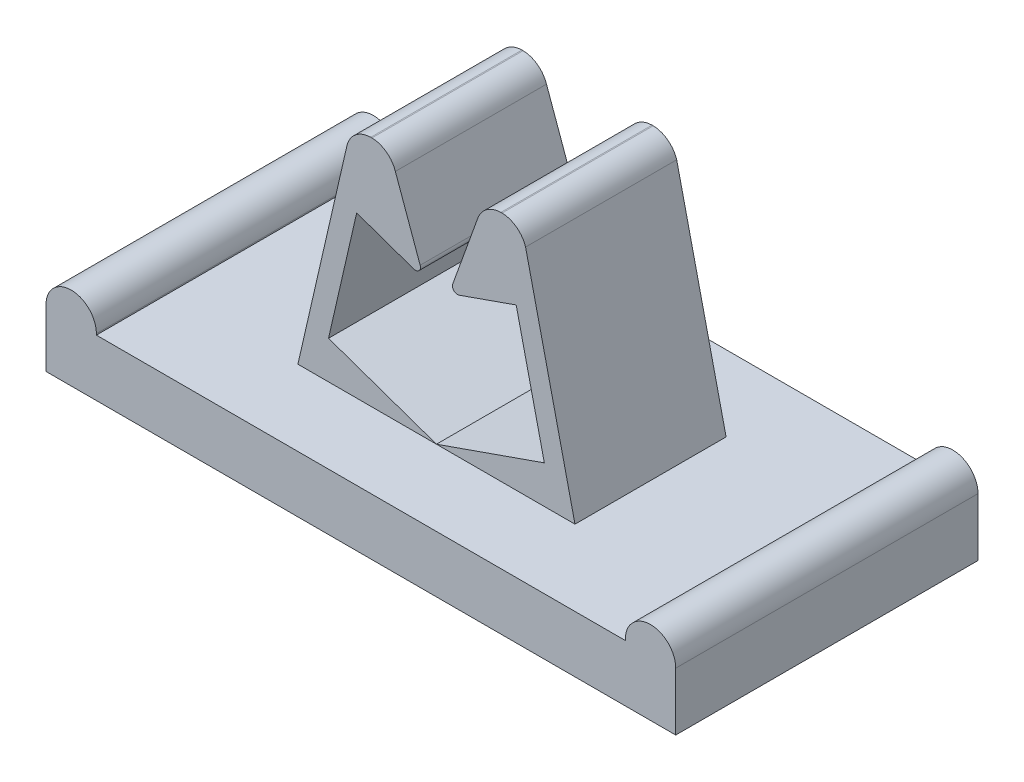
ISO-10303-21;
HEADER;
FILE_DESCRIPTION(('STEP AP214'),'2;1');
FILE_NAME('part.step','',(''),(''),'','','');
FILE_SCHEMA(('AUTOMOTIVE_DESIGN { 1 0 10303 214 1 1 1 1 }'));
ENDSEC;
DATA;
#1=APPLICATION_CONTEXT('core data for automotive mechanical design processes');
#2=APPLICATION_PROTOCOL_DEFINITION('international standard','automotive_design',2000,#1);
#3=PRODUCT_CONTEXT('',#1,'mechanical');
#4=PRODUCT('Part','Part','',(#3));
#5=PRODUCT_RELATED_PRODUCT_CATEGORY('part','',(#4));
#6=PRODUCT_DEFINITION_FORMATION('','',#4);
#7=PRODUCT_DEFINITION_CONTEXT('part definition',#1,'design');
#8=PRODUCT_DEFINITION('design','',#6,#7);
#9=PRODUCT_DEFINITION_SHAPE('','',#8);
#10=(LENGTH_UNIT() NAMED_UNIT(*) SI_UNIT(.MILLI.,.METRE.));
#11=(NAMED_UNIT(*) PLANE_ANGLE_UNIT() SI_UNIT($,.RADIAN.));
#12=(NAMED_UNIT(*) SI_UNIT($,.STERADIAN.) SOLID_ANGLE_UNIT());
#13=UNCERTAINTY_MEASURE_WITH_UNIT(LENGTH_MEASURE(1.E-05),#10,'distance_accuracy_value','');
#14=(GEOMETRIC_REPRESENTATION_CONTEXT(3) GLOBAL_UNCERTAINTY_ASSIGNED_CONTEXT((#13)) GLOBAL_UNIT_ASSIGNED_CONTEXT((#10,
#11,#12)) REPRESENTATION_CONTEXT('',''));
#15=CARTESIAN_POINT('',(0.,0.,0.));
#16=DIRECTION('',(0.,0.,1.));
#17=DIRECTION('',(1.,0.,0.));
#18=AXIS2_PLACEMENT_3D('',#15,#16,#17);
#19=CARTESIAN_POINT('',(0.,11.5,-12.));
#20=DIRECTION('',(0.,-1.,0.));
#21=DIRECTION('',(0.,0.,-1.));
#22=AXIS2_PLACEMENT_3D('',#19,#20,#21);
#23=PLANE('',#22);
#24=DIRECTION('',(0.,0.,1.));
#25=VECTOR('',#24,1.);
#26=CARTESIAN_POINT('',(9.94065149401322,11.5,-12.));
#27=LINE('',#26,#25);
#28=CARTESIAN_POINT('',(9.94065149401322,11.5,-9.));
#29=VERTEX_POINT('',#28);
#30=CARTESIAN_POINT('',(9.94065149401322,11.5,-3.));
#31=VERTEX_POINT('',#30);
#32=EDGE_CURVE('E396',#29,#31,#27,.T.);
#33=ORIENTED_EDGE('',*,*,#32,.F.);
#34=DIRECTION('',(-1.,0.,0.));
#35=VECTOR('',#34,1.);
#36=CARTESIAN_POINT('',(0.,11.5,-9.));
#37=LINE('',#36,#35);
#38=CARTESIAN_POINT('',(9.89434520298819,11.5,-9.));
#39=VERTEX_POINT('',#38);
#40=EDGE_CURVE('E774',#29,#39,#37,.T.);
#41=ORIENTED_EDGE('',*,*,#40,.T.);
#42=DIRECTION('',(0.,0.,1.));
#43=VECTOR('',#42,1.);
#44=CARTESIAN_POINT('',(9.89434520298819,11.5,-12.));
#45=LINE('',#44,#43);
#46=CARTESIAN_POINT('',(9.89434520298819,11.5,-3.));
#47=VERTEX_POINT('',#46);
#48=EDGE_CURVE('E376',#39,#47,#45,.T.);
#49=ORIENTED_EDGE('',*,*,#48,.T.);
#50=DIRECTION('',(1.,0.,0.));
#51=VECTOR('',#50,1.);
#52=CARTESIAN_POINT('',(0.,11.5,-3.));
#53=LINE('',#52,#51);
#54=EDGE_CURVE('E697',#47,#31,#53,.T.);
#55=ORIENTED_EDGE('',*,*,#54,.T.);
#56=EDGE_LOOP('',(#33,#41,#49,#55));
#57=FACE_BOUND('',#56,.T.);
#58=ADVANCED_FACE('F35',(#57),#23,.F.);
#59=CARTESIAN_POINT('',(25.,11.5,0.));
#60=DIRECTION('',(-1.,0.,0.));
#61=DIRECTION('',(0.,0.,1.));
#62=AXIS2_PLACEMENT_3D('',#59,#60,#61);
#63=PLANE('',#62);
#64=DIRECTION('',(0.,0.,1.));
#65=VECTOR('',#64,1.);
#66=CARTESIAN_POINT('',(25.,2.3,-12.));
#67=LINE('',#66,#65);
#68=CARTESIAN_POINT('',(25.,2.3,-12.));
#69=VERTEX_POINT('',#68);
#70=CARTESIAN_POINT('',(25.,2.3,0.));
#71=VERTEX_POINT('',#70);
#72=EDGE_CURVE('E255',#69,#71,#67,.T.);
#73=ORIENTED_EDGE('',*,*,#72,.T.);
#74=DIRECTION('',(0.,-1.,0.));
#75=VECTOR('',#74,1.);
#76=CARTESIAN_POINT('',(25.,11.5,0.));
#77=LINE('',#76,#75);
#78=CARTESIAN_POINT('',(25.,0.,0.));
#79=VERTEX_POINT('',#78);
#80=EDGE_CURVE('E275',#71,#79,#77,.T.);
#81=ORIENTED_EDGE('',*,*,#80,.T.);
#82=DIRECTION('',(0.,0.,-1.));
#83=VECTOR('',#82,1.);
#84=CARTESIAN_POINT('',(25.,0.,0.));
#85=LINE('',#84,#83);
#86=CARTESIAN_POINT('',(25.,0.,-12.));
#87=VERTEX_POINT('',#86);
#88=EDGE_CURVE('E265',#79,#87,#85,.T.);
#89=ORIENTED_EDGE('',*,*,#88,.T.);
#90=DIRECTION('',(0.,-1.,0.));
#91=VECTOR('',#90,1.);
#92=CARTESIAN_POINT('',(25.,11.5,-12.));
#93=LINE('',#92,#91);
#94=EDGE_CURVE('E273',#69,#87,#93,.T.);
#95=ORIENTED_EDGE('',*,*,#94,.F.);
#96=EDGE_LOOP('',(#73,#81,#89,#95));
#97=FACE_BOUND('',#96,.T.);
#98=ADVANCED_FACE('F302',(#97),#63,.F.);
#99=CARTESIAN_POINT('',(0.,11.5,0.));
#100=DIRECTION('',(1.,0.,0.));
#101=DIRECTION('',(0.,0.,-1.));
#102=AXIS2_PLACEMENT_3D('',#99,#100,#101);
#103=PLANE('',#102);
#104=DIRECTION('',(0.,-1.,0.));
#105=VECTOR('',#104,1.);
#106=CARTESIAN_POINT('',(0.,11.5,0.));
#107=LINE('',#106,#105);
#108=CARTESIAN_POINT('',(1.3392065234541E-12,2.3,0.));
#109=VERTEX_POINT('',#108);
#110=CARTESIAN_POINT('',(0.,0.,0.));
#111=VERTEX_POINT('',#110);
#112=EDGE_CURVE('E43',#109,#111,#107,.T.);
#113=ORIENTED_EDGE('',*,*,#112,.F.);
#114=DIRECTION('',(0.,0.,1.));
#115=VECTOR('',#114,1.);
#116=CARTESIAN_POINT('',(1.3392065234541E-12,2.3,-12.));
#117=LINE('',#116,#115);
#118=CARTESIAN_POINT('',(1.3392065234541E-12,2.3,-12.));
#119=VERTEX_POINT('',#118);
#120=EDGE_CURVE('E293',#119,#109,#117,.T.);
#121=ORIENTED_EDGE('',*,*,#120,.F.);
#122=DIRECTION('',(0.,-1.,0.));
#123=VECTOR('',#122,1.);
#124=CARTESIAN_POINT('',(0.,11.5,-12.));
#125=LINE('',#124,#123);
#126=CARTESIAN_POINT('',(0.,0.,-12.));
#127=VERTEX_POINT('',#126);
#128=EDGE_CURVE('E271',#119,#127,#125,.T.);
#129=ORIENTED_EDGE('',*,*,#128,.T.);
#130=DIRECTION('',(0.,0.,1.));
#131=VECTOR('',#130,1.);
#132=CARTESIAN_POINT('',(0.,0.,0.));
#133=LINE('',#132,#131);
#134=EDGE_CURVE('E242',#127,#111,#133,.T.);
#135=ORIENTED_EDGE('',*,*,#134,.T.);
#136=EDGE_LOOP('',(#113,#121,#129,#135));
#137=FACE_BOUND('',#136,.T.);
#138=ADVANCED_FACE('F37',(#137),#103,.F.);
#139=CARTESIAN_POINT('',(0.,11.5,0.));
#140=DIRECTION('',(0.,0.,-1.));
#141=DIRECTION('',(-1.,0.,0.));
#142=AXIS2_PLACEMENT_3D('',#139,#140,#141);
#143=PLANE('',#142);
#144=DIRECTION('',(1.,0.,0.));
#145=VECTOR('',#144,1.);
#146=CARTESIAN_POINT('',(18.0000000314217,2.24999995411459,0.));
#147=LINE('',#146,#145);
#148=CARTESIAN_POINT('',(2.00000000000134,2.24999995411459,0.));
#149=VERTEX_POINT('',#148);
#150=CARTESIAN_POINT('',(23.,2.24999995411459,0.));
#151=VERTEX_POINT('',#150);
#152=EDGE_CURVE('E313',#149,#151,#147,.T.);
#153=ORIENTED_EDGE('',*,*,#152,.F.);
#154=DIRECTION('',(0.,-1.,0.));
#155=VECTOR('',#154,1.);
#156=CARTESIAN_POINT('',(2.00000000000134,2.24999995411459,0.));
#157=LINE('',#156,#155);
#158=CARTESIAN_POINT('',(2.00000000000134,2.3,0.));
#159=VERTEX_POINT('',#158);
#160=EDGE_CURVE('E370',#159,#149,#157,.T.);
#161=ORIENTED_EDGE('',*,*,#160,.F.);
#162=CARTESIAN_POINT('',(1.00000000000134,2.3,0.));
#163=DIRECTION('',(0.,0.,-1.));
#164=DIRECTION('',(-1.,0.,0.));
#165=AXIS2_PLACEMENT_3D('',#162,#163,#164);
#166=CIRCLE('',#165,1.);
#167=EDGE_CURVE('E285',#109,#159,#166,.T.);
#168=ORIENTED_EDGE('',*,*,#167,.F.);
#169=ORIENTED_EDGE('',*,*,#112,.T.);
#170=DIRECTION('',(1.,0.,0.));
#171=VECTOR('',#170,1.);
#172=CARTESIAN_POINT('',(0.,0.,0.));
#173=LINE('',#172,#171);
#174=EDGE_CURVE('E246',#111,#79,#173,.T.);
#175=ORIENTED_EDGE('',*,*,#174,.T.);
#176=ORIENTED_EDGE('',*,*,#80,.F.);
#177=CARTESIAN_POINT('',(24.,2.3,0.));
#178=DIRECTION('',(0.,0.,-1.));
#179=DIRECTION('',(1.,0.,0.));
#180=AXIS2_PLACEMENT_3D('',#177,#178,#179);
#181=CIRCLE('',#180,1.);
#182=CARTESIAN_POINT('',(23.,2.3,0.));
#183=VERTEX_POINT('',#182);
#184=EDGE_CURVE('E305',#183,#71,#181,.T.);
#185=ORIENTED_EDGE('',*,*,#184,.F.);
#186=DIRECTION('',(0.,1.,0.));
#187=VECTOR('',#186,1.);
#188=CARTESIAN_POINT('',(23.,2.24999995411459,0.));
#189=LINE('',#188,#187);
#190=EDGE_CURVE('E307',#151,#183,#189,.T.);
#191=ORIENTED_EDGE('',*,*,#190,.F.);
#192=EDGE_LOOP('',(#153,#161,#168,#169,#175,#176,#185,#191));
#193=FACE_BOUND('',#192,.T.);
#194=ADVANCED_FACE('F280',(#193),#143,.F.);
#195=CARTESIAN_POINT('',(0.,11.5,-12.));
#196=DIRECTION('',(0.,0.,1.));
#197=DIRECTION('',(1.,0.,0.));
#198=AXIS2_PLACEMENT_3D('',#195,#196,#197);
#199=PLANE('',#198);
#200=DIRECTION('',(0.,-1.,0.));
#201=VECTOR('',#200,1.);
#202=CARTESIAN_POINT('',(2.00000000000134,2.24999995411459,-12.));
#203=LINE('',#202,#201);
#204=CARTESIAN_POINT('',(2.00000000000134,2.3,-12.));
#205=VERTEX_POINT('',#204);
#206=CARTESIAN_POINT('',(2.00000000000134,2.24999995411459,-12.));
#207=VERTEX_POINT('',#206);
#208=EDGE_CURVE('E57',#205,#207,#203,.T.);
#209=ORIENTED_EDGE('',*,*,#208,.T.);
#210=DIRECTION('',(1.,0.,0.));
#211=VECTOR('',#210,1.);
#212=CARTESIAN_POINT('',(18.0000000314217,2.24999995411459,-12.));
#213=LINE('',#212,#211);
#214=CARTESIAN_POINT('',(23.,2.24999995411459,-12.));
#215=VERTEX_POINT('',#214);
#216=EDGE_CURVE('E309',#207,#215,#213,.T.);
#217=ORIENTED_EDGE('',*,*,#216,.T.);
#218=DIRECTION('',(0.,1.,0.));
#219=VECTOR('',#218,1.);
#220=CARTESIAN_POINT('',(23.,2.24999995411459,-12.));
#221=LINE('',#220,#219);
#222=CARTESIAN_POINT('',(23.,2.3,-12.));
#223=VERTEX_POINT('',#222);
#224=EDGE_CURVE('E311',#215,#223,#221,.T.);
#225=ORIENTED_EDGE('',*,*,#224,.T.);
#226=CARTESIAN_POINT('',(24.,2.3,-12.));
#227=DIRECTION('',(0.,0.,-1.));
#228=DIRECTION('',(1.,0.,0.));
#229=AXIS2_PLACEMENT_3D('',#226,#227,#228);
#230=CIRCLE('',#229,1.);
#231=EDGE_CURVE('E251',#223,#69,#230,.T.);
#232=ORIENTED_EDGE('',*,*,#231,.T.);
#233=ORIENTED_EDGE('',*,*,#94,.T.);
#234=DIRECTION('',(-1.,0.,0.));
#235=VECTOR('',#234,1.);
#236=CARTESIAN_POINT('',(0.,0.,-12.));
#237=LINE('',#236,#235);
#238=EDGE_CURVE('E268',#87,#127,#237,.T.);
#239=ORIENTED_EDGE('',*,*,#238,.T.);
#240=ORIENTED_EDGE('',*,*,#128,.F.);
#241=CARTESIAN_POINT('',(1.00000000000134,2.3,-12.));
#242=DIRECTION('',(0.,0.,-1.));
#243=DIRECTION('',(-1.,0.,0.));
#244=AXIS2_PLACEMENT_3D('',#241,#242,#243);
#245=CIRCLE('',#244,1.);
#246=EDGE_CURVE('E373',#119,#205,#245,.T.);
#247=ORIENTED_EDGE('',*,*,#246,.T.);
#248=EDGE_LOOP('',(#209,#217,#225,#232,#233,#239,#240,#247));
#249=FACE_BOUND('',#248,.T.);
#250=ADVANCED_FACE('F296',(#249),#199,.F.);
#251=DIRECTION('',(0.,0.,1.));
#252=VECTOR('',#251,1.);
#253=CARTESIAN_POINT('',(15.1056547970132,11.5,-12.));
#254=LINE('',#253,#252);
#255=CARTESIAN_POINT('',(15.1056547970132,11.5,-9.));
#256=VERTEX_POINT('',#255);
#257=CARTESIAN_POINT('',(15.1056547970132,11.5,-3.));
#258=VERTEX_POINT('',#257);
#259=EDGE_CURVE('E248',#256,#258,#254,.T.);
#260=ORIENTED_EDGE('',*,*,#259,.F.);
#261=DIRECTION('',(-1.,0.,0.));
#262=VECTOR('',#261,1.);
#263=CARTESIAN_POINT('',(0.,11.5,-9.));
#264=LINE('',#263,#262);
#265=CARTESIAN_POINT('',(15.0593485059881,11.5,-9.));
#266=VERTEX_POINT('',#265);
#267=EDGE_CURVE('E352',#256,#266,#264,.T.);
#268=ORIENTED_EDGE('',*,*,#267,.T.);
#269=DIRECTION('',(0.,0.,1.));
#270=VECTOR('',#269,1.);
#271=CARTESIAN_POINT('',(15.0593485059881,11.5,-12.));
#272=LINE('',#271,#270);
#273=CARTESIAN_POINT('',(15.0593485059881,11.5,-3.));
#274=VERTEX_POINT('',#273);
#275=EDGE_CURVE('E398',#266,#274,#272,.T.);
#276=ORIENTED_EDGE('',*,*,#275,.T.);
#277=DIRECTION('',(1.,0.,0.));
#278=VECTOR('',#277,1.);
#279=CARTESIAN_POINT('',(0.,11.5,-3.));
#280=LINE('',#279,#278);
#281=EDGE_CURVE('E355',#274,#258,#280,.T.);
#282=ORIENTED_EDGE('',*,*,#281,.T.);
#283=EDGE_LOOP('',(#260,#268,#276,#282));
#284=FACE_BOUND('',#283,.T.);
#285=ADVANCED_FACE('F335',(#284),#23,.F.);
#286=CARTESIAN_POINT('',(0.,0.,-12.));
#287=DIRECTION('',(0.,-1.,0.));
#288=DIRECTION('',(0.,0.,-1.));
#289=AXIS2_PLACEMENT_3D('',#286,#287,#288);
#290=PLANE('',#289);
#291=ORIENTED_EDGE('',*,*,#134,.F.);
#292=ORIENTED_EDGE('',*,*,#238,.F.);
#293=ORIENTED_EDGE('',*,*,#88,.F.);
#294=ORIENTED_EDGE('',*,*,#174,.F.);
#295=EDGE_LOOP('',(#291,#292,#293,#294));
#296=FACE_BOUND('',#295,.T.);
#297=ADVANCED_FACE('F290',(#296),#290,.T.);
#298=CARTESIAN_POINT('',(18.0000000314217,2.24999995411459,-12.));
#299=DIRECTION('',(0.,-1.,0.));
#300=DIRECTION('',(0.,0.,-1.));
#301=AXIS2_PLACEMENT_3D('',#298,#299,#300);
#302=PLANE('',#301);
#303=DIRECTION('',(-1.,0.,0.));
#304=VECTOR('',#303,1.);
#305=CARTESIAN_POINT('',(20.,2.25,-9.));
#306=LINE('',#305,#304);
#307=CARTESIAN_POINT('',(18.0000000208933,2.25,-9.));
#308=VERTEX_POINT('',#307);
#309=CARTESIAN_POINT('',(12.5000000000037,2.25,-9.));
#310=VERTEX_POINT('',#309);
#311=EDGE_CURVE('E219',#308,#310,#306,.T.);
#312=ORIENTED_EDGE('',*,*,#311,.F.);
#313=DIRECTION('',(0.,0.,1.));
#314=VECTOR('',#313,1.);
#315=CARTESIAN_POINT('',(18.0000000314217,2.24999995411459,-12.));
#316=LINE('',#315,#314);
#317=CARTESIAN_POINT('',(18.0000000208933,2.25,-3.));
#318=VERTEX_POINT('',#317);
#319=EDGE_CURVE('E233',#308,#318,#316,.T.);
#320=ORIENTED_EDGE('',*,*,#319,.T.);
#321=DIRECTION('',(-1.,0.,0.));
#322=VECTOR('',#321,1.);
#323=CARTESIAN_POINT('',(20.,2.25,-3.));
#324=LINE('',#323,#322);
#325=CARTESIAN_POINT('',(12.5000000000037,2.25,-3.));
#326=VERTEX_POINT('',#325);
#327=EDGE_CURVE('E686',#318,#326,#324,.T.);
#328=ORIENTED_EDGE('',*,*,#327,.T.);
#329=CARTESIAN_POINT('',(6.9999999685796,2.24999995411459,-3.));
#330=VERTEX_POINT('',#329);
#331=EDGE_CURVE('E226',#326,#330,#324,.T.);
#332=ORIENTED_EDGE('',*,*,#331,.T.);
#333=DIRECTION('',(0.,0.,1.));
#334=VECTOR('',#333,1.);
#335=CARTESIAN_POINT('',(6.9999999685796,2.24999995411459,-12.));
#336=LINE('',#335,#334);
#337=CARTESIAN_POINT('',(6.99999997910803,2.25,-9.));
#338=VERTEX_POINT('',#337);
#339=EDGE_CURVE('E49',#338,#330,#336,.T.);
#340=ORIENTED_EDGE('',*,*,#339,.F.);
#341=EDGE_CURVE('E235',#310,#338,#306,.T.);
#342=ORIENTED_EDGE('',*,*,#341,.F.);
#343=EDGE_LOOP('',(#312,#320,#328,#332,#340,#342));
#344=FACE_BOUND('',#343,.T.);
#345=DIRECTION('',(0.,0.,1.));
#346=VECTOR('',#345,1.);
#347=CARTESIAN_POINT('',(23.,2.24999995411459,-12.));
#348=LINE('',#347,#346);
#349=EDGE_CURVE('E260',#215,#151,#348,.T.);
#350=ORIENTED_EDGE('',*,*,#349,.F.);
#351=ORIENTED_EDGE('',*,*,#216,.F.);
#352=DIRECTION('',(0.,0.,1.));
#353=VECTOR('',#352,1.);
#354=CARTESIAN_POINT('',(2.00000000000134,2.24999995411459,-12.));
#355=LINE('',#354,#353);
#356=EDGE_CURVE('E381',#207,#149,#355,.T.);
#357=ORIENTED_EDGE('',*,*,#356,.T.);
#358=ORIENTED_EDGE('',*,*,#152,.T.);
#359=EDGE_LOOP('',(#350,#351,#357,#358));
#360=FACE_BOUND('',#359,.T.);
#361=ADVANCED_FACE('F230',(#344,#360),#302,.F.);
#362=CARTESIAN_POINT('',(16.038627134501,10.7981391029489,-12.));
#363=DIRECTION('',(-0.97467209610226,-0.223638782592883,0.));
#364=DIRECTION('',(0.223638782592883,-0.97467209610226,0.));
#365=AXIS2_PLACEMENT_3D('',#362,#363,#364);
#366=PLANE('',#365);
#367=ORIENTED_EDGE('',*,*,#319,.F.);
#368=DIRECTION('',(-0.223638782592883,0.97467209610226,0.));
#369=VECTOR('',#368,1.);
#370=CARTESIAN_POINT('',(16.038627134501,10.7981391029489,-9.));
#371=LINE('',#370,#369);
#372=CARTESIAN_POINT('',(16.038627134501,10.7981391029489,-9.));
#373=VERTEX_POINT('',#372);
#374=EDGE_CURVE('E216',#308,#373,#371,.T.);
#375=ORIENTED_EDGE('',*,*,#374,.T.);
#376=DIRECTION('',(0.,0.,1.));
#377=VECTOR('',#376,1.);
#378=CARTESIAN_POINT('',(16.038627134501,10.7981391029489,-12.));
#379=LINE('',#378,#377);
#380=CARTESIAN_POINT('',(16.038627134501,10.7981391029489,-3.));
#381=VERTEX_POINT('',#380);
#382=EDGE_CURVE('E243',#373,#381,#379,.T.);
#383=ORIENTED_EDGE('',*,*,#382,.T.);
#384=DIRECTION('',(0.223638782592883,-0.97467209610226,0.));
#385=VECTOR('',#384,1.);
#386=CARTESIAN_POINT('',(16.038627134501,10.7981391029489,-3.));
#387=LINE('',#386,#385);
#388=EDGE_CURVE('E241',#381,#318,#387,.T.);
#389=ORIENTED_EDGE('',*,*,#388,.T.);
#390=EDGE_LOOP('',(#367,#375,#383,#389));
#391=FACE_BOUND('',#390,.T.);
#392=ADVANCED_FACE('F239',(#391),#366,.F.);
#393=CARTESIAN_POINT('',(15.0825016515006,10.4981999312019,-12.));
#394=DIRECTION('',(0.,0.,1.));
#395=DIRECTION('',(1.,0.,0.));
#396=AXIS2_PLACEMENT_3D('',#393,#394,#395);
#397=CYLINDRICAL_SURFACE('',#396,1.00206758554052);
#398=ORIENTED_EDGE('',*,*,#382,.F.);
#399=CARTESIAN_POINT('',(15.0825016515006,10.4981999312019,-9.));
#400=DIRECTION('',(0.,0.,1.));
#401=DIRECTION('',(1.,0.,0.));
#402=AXIS2_PLACEMENT_3D('',#399,#400,#401);
#403=CIRCLE('',#402,1.00206758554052);
#404=EDGE_CURVE('E222',#373,#256,#403,.T.);
#405=ORIENTED_EDGE('',*,*,#404,.T.);
#406=ORIENTED_EDGE('',*,*,#259,.T.);
#407=CARTESIAN_POINT('',(15.0825016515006,10.4981999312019,-3.));
#408=DIRECTION('',(0.,0.,-1.));
#409=DIRECTION('',(-1.,0.,0.));
#410=AXIS2_PLACEMENT_3D('',#407,#408,#409);
#411=CIRCLE('',#410,1.00206758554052);
#412=EDGE_CURVE('E358',#258,#381,#411,.T.);
#413=ORIENTED_EDGE('',*,*,#412,.T.);
#414=EDGE_LOOP('',(#398,#405,#406,#413));
#415=FACE_BOUND('',#414,.T.);
#416=ADVANCED_FACE('F322',(#415),#397,.T.);
#417=CARTESIAN_POINT('',(24.,2.3,-12.));
#418=DIRECTION('',(0.,0.,1.));
#419=DIRECTION('',(1.,0.,0.));
#420=AXIS2_PLACEMENT_3D('',#417,#418,#419);
#421=CYLINDRICAL_SURFACE('',#420,1.);
#422=ORIENTED_EDGE('',*,*,#184,.T.);
#423=ORIENTED_EDGE('',*,*,#72,.F.);
#424=ORIENTED_EDGE('',*,*,#231,.F.);
#425=DIRECTION('',(0.,0.,1.));
#426=VECTOR('',#425,1.);
#427=CARTESIAN_POINT('',(23.,2.3,-12.));
#428=LINE('',#427,#426);
#429=EDGE_CURVE('E258',#223,#183,#428,.T.);
#430=ORIENTED_EDGE('',*,*,#429,.T.);
#431=EDGE_LOOP('',(#422,#423,#424,#430));
#432=FACE_BOUND('',#431,.T.);
#433=ADVANCED_FACE('F320',(#432),#421,.T.);
#434=CARTESIAN_POINT('',(23.,2.24999995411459,-12.));
#435=DIRECTION('',(1.,0.,0.));
#436=DIRECTION('',(0.,0.,-1.));
#437=AXIS2_PLACEMENT_3D('',#434,#435,#436);
#438=PLANE('',#437);
#439=ORIENTED_EDGE('',*,*,#190,.T.);
#440=ORIENTED_EDGE('',*,*,#429,.F.);
#441=ORIENTED_EDGE('',*,*,#224,.F.);
#442=ORIENTED_EDGE('',*,*,#349,.T.);
#443=EDGE_LOOP('',(#439,#440,#441,#442));
#444=FACE_BOUND('',#443,.T.);
#445=ADVANCED_FACE('F319',(#444),#438,.F.);
#446=CARTESIAN_POINT('',(9.3335647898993,8.61946996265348,-12.));
#447=DIRECTION('',(-0.974672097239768,0.223638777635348,0.));
#448=DIRECTION('',(-0.223638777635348,-0.974672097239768,0.));
#449=AXIS2_PLACEMENT_3D('',#446,#447,#448);
#450=PLANE('',#449);
#451=DIRECTION('',(0.,0.,1.));
#452=VECTOR('',#451,1.);
#453=CARTESIAN_POINT('',(8.21626358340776,3.75000000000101,-12.));
#454=LINE('',#453,#452);
#455=CARTESIAN_POINT('',(8.21626358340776,3.75000000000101,-9.));
#456=VERTEX_POINT('',#455);
#457=CARTESIAN_POINT('',(8.21626358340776,3.75000000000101,-3.));
#458=VERTEX_POINT('',#457);
#459=EDGE_CURVE('E379',#456,#458,#454,.T.);
#460=ORIENTED_EDGE('',*,*,#459,.F.);
#461=DIRECTION('',(0.223638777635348,0.974672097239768,0.));
#462=VECTOR('',#461,1.);
#463=CARTESIAN_POINT('',(9.3335647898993,8.61946996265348,-9.));
#464=LINE('',#463,#462);
#465=CARTESIAN_POINT('',(9.3335647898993,8.61946996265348,-9.));
#466=VERTEX_POINT('',#465);
#467=EDGE_CURVE('E758',#456,#466,#464,.T.);
#468=ORIENTED_EDGE('',*,*,#467,.T.);
#469=DIRECTION('',(0.,0.,1.));
#470=VECTOR('',#469,1.);
#471=CARTESIAN_POINT('',(9.3335647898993,8.61946996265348,-12.));
#472=LINE('',#471,#470);
#473=CARTESIAN_POINT('',(9.3335647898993,8.61946996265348,-3.));
#474=VERTEX_POINT('',#473);
#475=EDGE_CURVE('E388',#466,#474,#472,.T.);
#476=ORIENTED_EDGE('',*,*,#475,.T.);
#477=DIRECTION('',(-0.223638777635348,-0.974672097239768,0.));
#478=VECTOR('',#477,1.);
#479=CARTESIAN_POINT('',(9.3335647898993,8.61946996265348,-3.));
#480=LINE('',#479,#478);
#481=EDGE_CURVE('E714',#474,#458,#480,.T.);
#482=ORIENTED_EDGE('',*,*,#481,.T.);
#483=EDGE_LOOP('',(#460,#468,#476,#482));
#484=FACE_BOUND('',#483,.T.);
#485=ADVANCED_FACE('F328',(#484),#450,.F.);
#486=CARTESIAN_POINT('',(9.3335647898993,8.61946996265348,-12.));
#487=DIRECTION('',(0.331571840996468,0.943429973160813,0.));
#488=DIRECTION('',(-0.943429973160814,0.331571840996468,0.));
#489=AXIS2_PLACEMENT_3D('',#486,#487,#488);
#490=PLANE('',#489);
#491=ORIENTED_EDGE('',*,*,#475,.F.);
#492=DIRECTION('',(0.943429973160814,-0.331571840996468,0.));
#493=VECTOR('',#492,1.);
#494=CARTESIAN_POINT('',(9.3335647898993,8.61946996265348,-9.));
#495=LINE('',#494,#493);
#496=CARTESIAN_POINT('',(11.5990840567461,7.82324510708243,-9.));
#497=VERTEX_POINT('',#496);
#498=EDGE_CURVE('E760',#466,#497,#495,.T.);
#499=ORIENTED_EDGE('',*,*,#498,.T.);
#500=DIRECTION('',(0.,0.,1.));
#501=VECTOR('',#500,1.);
#502=CARTESIAN_POINT('',(11.5990840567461,7.82324510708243,-12.));
#503=LINE('',#502,#501);
#504=CARTESIAN_POINT('',(11.5990840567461,7.82324510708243,-3.));
#505=VERTEX_POINT('',#504);
#506=EDGE_CURVE('E390',#497,#505,#503,.T.);
#507=ORIENTED_EDGE('',*,*,#506,.T.);
#508=DIRECTION('',(-0.943429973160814,0.331571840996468,0.));
#509=VECTOR('',#508,1.);
#510=CARTESIAN_POINT('',(9.3335647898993,8.61946996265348,-3.));
#511=LINE('',#510,#509);
#512=EDGE_CURVE('E711',#505,#474,#511,.T.);
#513=ORIENTED_EDGE('',*,*,#512,.T.);
#514=EDGE_LOOP('',(#491,#499,#507,#513));
#515=FACE_BOUND('',#514,.T.);
#516=ADVANCED_FACE('F432',(#515),#490,.F.);
#517=CARTESIAN_POINT('',(11.6653984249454,8.01193110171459,-12.));
#518=DIRECTION('',(0.,0.,1.));
#519=DIRECTION('',(1.,0.,0.));
#520=AXIS2_PLACEMENT_3D('',#517,#518,#519);
#521=CYLINDRICAL_SURFACE('',#520,0.2);
#522=ORIENTED_EDGE('',*,*,#506,.F.);
#523=CARTESIAN_POINT('',(11.6653984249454,8.01193110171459,-9.));
#524=DIRECTION('',(0.,0.,1.));
#525=DIRECTION('',(1.,0.,0.));
#526=AXIS2_PLACEMENT_3D('',#523,#524,#525);
#527=CIRCLE('',#526,0.2);
#528=CARTESIAN_POINT('',(11.8535593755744,8.07972089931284,-9.));
#529=VERTEX_POINT('',#528);
#530=EDGE_CURVE('E766',#497,#529,#527,.T.);
#531=ORIENTED_EDGE('',*,*,#530,.T.);
#532=DIRECTION('',(0.,0.,1.));
#533=VECTOR('',#532,1.);
#534=CARTESIAN_POINT('',(11.8535593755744,8.07972089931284,-12.));
#535=LINE('',#534,#533);
#536=CARTESIAN_POINT('',(11.8535593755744,8.07972089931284,-3.));
#537=VERTEX_POINT('',#536);
#538=EDGE_CURVE('E392',#529,#537,#535,.T.);
#539=ORIENTED_EDGE('',*,*,#538,.T.);
#540=CARTESIAN_POINT('',(11.6653984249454,8.01193110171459,-3.));
#541=DIRECTION('',(0.,0.,-1.));
#542=DIRECTION('',(-1.,0.,0.));
#543=AXIS2_PLACEMENT_3D('',#540,#541,#542);
#544=CIRCLE('',#543,0.2);
#545=EDGE_CURVE('E708',#537,#505,#544,.T.);
#546=ORIENTED_EDGE('',*,*,#545,.T.);
#547=EDGE_LOOP('',(#522,#531,#539,#546));
#548=FACE_BOUND('',#547,.T.);
#549=ADVANCED_FACE('F435',(#548),#521,.T.);
#550=CARTESIAN_POINT('',(11.8535593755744,8.07972089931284,-12.));
#551=DIRECTION('',(-0.940804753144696,-0.33894898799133,0.));
#552=DIRECTION('',(0.33894898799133,-0.940804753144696,0.));
#553=AXIS2_PLACEMENT_3D('',#550,#551,#552);
#554=PLANE('',#553);
#555=ORIENTED_EDGE('',*,*,#538,.F.);
#556=DIRECTION('',(-0.33894898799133,0.940804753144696,0.));
#557=VECTOR('',#556,1.);
#558=CARTESIAN_POINT('',(11.8535593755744,8.07972089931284,-9.));
#559=LINE('',#558,#557);
#560=CARTESIAN_POINT('',(10.8689330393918,10.8127018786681,-9.));
#561=VERTEX_POINT('',#560);
#562=EDGE_CURVE('E768',#529,#561,#559,.T.);
#563=ORIENTED_EDGE('',*,*,#562,.T.);
#564=DIRECTION('',(0.,0.,1.));
#565=VECTOR('',#564,1.);
#566=CARTESIAN_POINT('',(10.8689330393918,10.8127018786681,-12.));
#567=LINE('',#566,#565);
#568=CARTESIAN_POINT('',(10.8689330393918,10.8127018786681,-3.));
#569=VERTEX_POINT('',#568);
#570=EDGE_CURVE('E394',#561,#569,#567,.T.);
#571=ORIENTED_EDGE('',*,*,#570,.T.);
#572=DIRECTION('',(0.33894898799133,-0.940804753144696,0.));
#573=VECTOR('',#572,1.);
#574=CARTESIAN_POINT('',(11.8535593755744,8.07972089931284,-3.));
#575=LINE('',#574,#573);
#576=EDGE_CURVE('E705',#569,#537,#575,.T.);
#577=ORIENTED_EDGE('',*,*,#576,.T.);
#578=EDGE_LOOP('',(#555,#563,#571,#577));
#579=FACE_BOUND('',#578,.T.);
#580=ADVANCED_FACE('F439',(#579),#554,.F.);
#581=CARTESIAN_POINT('',(9.91749834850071,10.4981999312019,-12.));
#582=DIRECTION('',(0.,0.,1.));
#583=DIRECTION('',(1.,0.,0.));
#584=AXIS2_PLACEMENT_3D('',#581,#582,#583);
#585=CYLINDRICAL_SURFACE('',#584,1.00206758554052);
#586=ORIENTED_EDGE('',*,*,#570,.F.);
#587=CARTESIAN_POINT('',(9.91749834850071,10.4981999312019,-9.));
#588=DIRECTION('',(0.,0.,1.));
#589=DIRECTION('',(1.,0.,0.));
#590=AXIS2_PLACEMENT_3D('',#587,#588,#589);
#591=CIRCLE('',#590,1.00206758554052);
#592=EDGE_CURVE('E772',#561,#29,#591,.T.);
#593=ORIENTED_EDGE('',*,*,#592,.T.);
#594=ORIENTED_EDGE('',*,*,#32,.T.);
#595=CARTESIAN_POINT('',(9.91749834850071,10.4981999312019,-3.));
#596=DIRECTION('',(0.,0.,-1.));
#597=DIRECTION('',(-1.,0.,0.));
#598=AXIS2_PLACEMENT_3D('',#595,#596,#597);
#599=CIRCLE('',#598,1.00206758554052);
#600=EDGE_CURVE('E702',#31,#569,#599,.T.);
#601=ORIENTED_EDGE('',*,*,#600,.T.);
#602=EDGE_LOOP('',(#586,#593,#594,#601));
#603=FACE_BOUND('',#602,.T.);
#604=ADVANCED_FACE('F443',(#603),#585,.T.);
#605=CARTESIAN_POINT('',(15.0825016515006,10.4981999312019,-12.));
#606=DIRECTION('',(0.,0.,1.));
#607=DIRECTION('',(1.,0.,0.));
#608=AXIS2_PLACEMENT_3D('',#605,#606,#607);
#609=CYLINDRICAL_SURFACE('',#608,1.00206758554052);
#610=ORIENTED_EDGE('',*,*,#275,.F.);
#611=CARTESIAN_POINT('',(15.0825016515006,10.4981999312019,-9.));
#612=DIRECTION('',(0.,0.,1.));
#613=DIRECTION('',(1.,0.,0.));
#614=AXIS2_PLACEMENT_3D('',#611,#612,#613);
#615=CIRCLE('',#614,1.00206758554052);
#616=CARTESIAN_POINT('',(14.1310669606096,10.8127018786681,-9.));
#617=VERTEX_POINT('',#616);
#618=EDGE_CURVE('E790',#266,#617,#615,.T.);
#619=ORIENTED_EDGE('',*,*,#618,.T.);
#620=DIRECTION('',(0.,0.,1.));
#621=VECTOR('',#620,1.);
#622=CARTESIAN_POINT('',(14.1310669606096,10.8127018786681,-12.));
#623=LINE('',#622,#621);
#624=CARTESIAN_POINT('',(14.1310669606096,10.8127018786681,-3.));
#625=VERTEX_POINT('',#624);
#626=EDGE_CURVE('E400',#617,#625,#623,.T.);
#627=ORIENTED_EDGE('',*,*,#626,.T.);
#628=CARTESIAN_POINT('',(15.0825016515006,10.4981999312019,-3.));
#629=DIRECTION('',(0.,0.,-1.));
#630=DIRECTION('',(-1.,0.,0.));
#631=AXIS2_PLACEMENT_3D('',#628,#629,#630);
#632=CIRCLE('',#631,1.00206758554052);
#633=EDGE_CURVE('E365',#625,#274,#632,.T.);
#634=ORIENTED_EDGE('',*,*,#633,.T.);
#635=EDGE_LOOP('',(#610,#619,#627,#634));
#636=FACE_BOUND('',#635,.T.);
#637=ADVANCED_FACE('F447',(#636),#609,.T.);
#638=CARTESIAN_POINT('',(13.146440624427,8.07972089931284,-12.));
#639=DIRECTION('',(0.940804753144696,-0.33894898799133,0.));
#640=DIRECTION('',(0.33894898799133,0.940804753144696,0.));
#641=AXIS2_PLACEMENT_3D('',#638,#639,#640);
#642=PLANE('',#641);
#643=ORIENTED_EDGE('',*,*,#626,.F.);
#644=DIRECTION('',(-0.33894898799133,-0.940804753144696,0.));
#645=VECTOR('',#644,1.);
#646=CARTESIAN_POINT('',(13.146440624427,8.07972089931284,-9.));
#647=LINE('',#646,#645);
#648=CARTESIAN_POINT('',(13.146440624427,8.07972089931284,-9.));
#649=VERTEX_POINT('',#648);
#650=EDGE_CURVE('E739',#617,#649,#647,.T.);
#651=ORIENTED_EDGE('',*,*,#650,.T.);
#652=DIRECTION('',(0.,0.,1.));
#653=VECTOR('',#652,1.);
#654=CARTESIAN_POINT('',(13.146440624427,8.07972089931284,-12.));
#655=LINE('',#654,#653);
#656=CARTESIAN_POINT('',(13.146440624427,8.07972089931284,-3.));
#657=VERTEX_POINT('',#656);
#658=EDGE_CURVE('E402',#649,#657,#655,.T.);
#659=ORIENTED_EDGE('',*,*,#658,.T.);
#660=DIRECTION('',(0.33894898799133,0.940804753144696,0.));
#661=VECTOR('',#660,1.);
#662=CARTESIAN_POINT('',(13.146440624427,8.07972089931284,-3.));
#663=LINE('',#662,#661);
#664=EDGE_CURVE('E731',#657,#625,#663,.T.);
#665=ORIENTED_EDGE('',*,*,#664,.T.);
#666=EDGE_LOOP('',(#643,#651,#659,#665));
#667=FACE_BOUND('',#666,.T.);
#668=ADVANCED_FACE('F451',(#667),#642,.F.);
#669=CARTESIAN_POINT('',(13.3346015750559,8.01193110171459,-12.));
#670=DIRECTION('',(0.,0.,1.));
#671=DIRECTION('',(1.,0.,0.));
#672=AXIS2_PLACEMENT_3D('',#669,#670,#671);
#673=CYLINDRICAL_SURFACE('',#672,0.2);
#674=ORIENTED_EDGE('',*,*,#658,.F.);
#675=CARTESIAN_POINT('',(13.3346015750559,8.01193110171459,-9.));
#676=DIRECTION('',(0.,0.,1.));
#677=DIRECTION('',(1.,0.,0.));
#678=AXIS2_PLACEMENT_3D('',#675,#676,#677);
#679=CIRCLE('',#678,0.2);
#680=CARTESIAN_POINT('',(13.4009159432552,7.82324510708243,-9.));
#681=VERTEX_POINT('',#680);
#682=EDGE_CURVE('E741',#649,#681,#679,.T.);
#683=ORIENTED_EDGE('',*,*,#682,.T.);
#684=DIRECTION('',(0.,0.,1.));
#685=VECTOR('',#684,1.);
#686=CARTESIAN_POINT('',(13.4009159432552,7.82324510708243,-12.));
#687=LINE('',#686,#685);
#688=CARTESIAN_POINT('',(13.4009159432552,7.82324510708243,-3.));
#689=VERTEX_POINT('',#688);
#690=EDGE_CURVE('E404',#681,#689,#687,.T.);
#691=ORIENTED_EDGE('',*,*,#690,.T.);
#692=CARTESIAN_POINT('',(13.3346015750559,8.01193110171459,-3.));
#693=DIRECTION('',(0.,0.,-1.));
#694=DIRECTION('',(-1.,0.,0.));
#695=AXIS2_PLACEMENT_3D('',#692,#693,#694);
#696=CIRCLE('',#695,0.2);
#697=EDGE_CURVE('E728',#689,#657,#696,.T.);
#698=ORIENTED_EDGE('',*,*,#697,.T.);
#699=EDGE_LOOP('',(#674,#683,#691,#698));
#700=FACE_BOUND('',#699,.T.);
#701=ADVANCED_FACE('F455',(#700),#673,.T.);
#702=CARTESIAN_POINT('',(15.666435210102,8.61946996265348,-12.));
#703=DIRECTION('',(-0.331571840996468,0.943429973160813,0.));
#704=DIRECTION('',(-0.943429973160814,-0.331571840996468,0.));
#705=AXIS2_PLACEMENT_3D('',#702,#703,#704);
#706=PLANE('',#705);
#707=ORIENTED_EDGE('',*,*,#690,.F.);
#708=DIRECTION('',(0.943429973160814,0.331571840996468,0.));
#709=VECTOR('',#708,1.);
#710=CARTESIAN_POINT('',(15.666435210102,8.61946996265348,-9.));
#711=LINE('',#710,#709);
#712=CARTESIAN_POINT('',(15.666435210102,8.61946996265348,-9.));
#713=VERTEX_POINT('',#712);
#714=EDGE_CURVE('E747',#681,#713,#711,.T.);
#715=ORIENTED_EDGE('',*,*,#714,.T.);
#716=DIRECTION('',(0.,0.,1.));
#717=VECTOR('',#716,1.);
#718=CARTESIAN_POINT('',(15.666435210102,8.61946996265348,-12.));
#719=LINE('',#718,#717);
#720=CARTESIAN_POINT('',(15.666435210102,8.61946996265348,-3.));
#721=VERTEX_POINT('',#720);
#722=EDGE_CURVE('E406',#713,#721,#719,.T.);
#723=ORIENTED_EDGE('',*,*,#722,.T.);
#724=DIRECTION('',(-0.943429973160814,-0.331571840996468,0.));
#725=VECTOR('',#724,1.);
#726=CARTESIAN_POINT('',(15.666435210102,8.61946996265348,-3.));
#727=LINE('',#726,#725);
#728=EDGE_CURVE('E725',#721,#689,#727,.T.);
#729=ORIENTED_EDGE('',*,*,#728,.T.);
#730=EDGE_LOOP('',(#707,#715,#723,#729));
#731=FACE_BOUND('',#730,.T.);
#732=ADVANCED_FACE('F459',(#731),#706,.F.);
#733=CARTESIAN_POINT('',(15.666435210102,8.61946996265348,-12.));
#734=DIRECTION('',(0.974672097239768,0.223638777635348,0.));
#735=DIRECTION('',(-0.223638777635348,0.974672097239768,0.));
#736=AXIS2_PLACEMENT_3D('',#733,#734,#735);
#737=PLANE('',#736);
#738=ORIENTED_EDGE('',*,*,#722,.F.);
#739=DIRECTION('',(0.223638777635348,-0.974672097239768,0.));
#740=VECTOR('',#739,1.);
#741=CARTESIAN_POINT('',(15.666435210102,8.61946996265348,-9.));
#742=LINE('',#741,#740);
#743=CARTESIAN_POINT('',(16.7837364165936,3.75000000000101,-9.));
#744=VERTEX_POINT('',#743);
#745=EDGE_CURVE('E749',#713,#744,#742,.T.);
#746=ORIENTED_EDGE('',*,*,#745,.T.);
#747=DIRECTION('',(0.,0.,1.));
#748=VECTOR('',#747,1.);
#749=CARTESIAN_POINT('',(16.7837364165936,3.75000000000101,-12.));
#750=LINE('',#749,#748);
#751=CARTESIAN_POINT('',(16.7837364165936,3.75000000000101,-3.));
#752=VERTEX_POINT('',#751);
#753=EDGE_CURVE('E408',#744,#752,#750,.T.);
#754=ORIENTED_EDGE('',*,*,#753,.T.);
#755=DIRECTION('',(-0.223638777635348,0.974672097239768,0.));
#756=VECTOR('',#755,1.);
#757=CARTESIAN_POINT('',(15.666435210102,8.61946996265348,-3.));
#758=LINE('',#757,#756);
#759=EDGE_CURVE('E722',#752,#721,#758,.T.);
#760=ORIENTED_EDGE('',*,*,#759,.T.);
#761=EDGE_LOOP('',(#738,#746,#754,#760));
#762=FACE_BOUND('',#761,.T.);
#763=ADVANCED_FACE('F463',(#762),#737,.F.);
#764=CARTESIAN_POINT('',(12.5000000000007,2.25000000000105,-12.));
#765=DIRECTION('',(0.330486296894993,-0.943810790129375,0.));
#766=DIRECTION('',(0.943810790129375,0.330486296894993,0.));
#767=AXIS2_PLACEMENT_3D('',#764,#765,#766);
#768=PLANE('',#767);
#769=ORIENTED_EDGE('',*,*,#753,.F.);
#770=DIRECTION('',(-0.943810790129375,-0.330486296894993,0.));
#771=VECTOR('',#770,1.);
#772=CARTESIAN_POINT('',(12.5000000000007,2.25000000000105,-9.));
#773=LINE('',#772,#771);
#774=EDGE_CURVE('E753',#744,#310,#773,.T.);
#775=ORIENTED_EDGE('',*,*,#774,.T.);
#776=DIRECTION('',(0.,0.,1.));
#777=VECTOR('',#776,1.);
#778=CARTESIAN_POINT('',(12.5000000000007,2.25000000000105,-12.));
#779=LINE('',#778,#777);
#780=EDGE_CURVE('E410',#310,#326,#779,.T.);
#781=ORIENTED_EDGE('',*,*,#780,.T.);
#782=DIRECTION('',(0.943810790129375,0.330486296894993,0.));
#783=VECTOR('',#782,1.);
#784=CARTESIAN_POINT('',(12.5000000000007,2.25000000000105,-3.));
#785=LINE('',#784,#783);
#786=EDGE_CURVE('E719',#326,#752,#785,.T.);
#787=ORIENTED_EDGE('',*,*,#786,.T.);
#788=EDGE_LOOP('',(#769,#775,#781,#787));
#789=FACE_BOUND('',#788,.T.);
#790=ADVANCED_FACE('F467',(#789),#768,.F.);
#791=CARTESIAN_POINT('',(12.5000000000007,2.25000000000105,-12.));
#792=DIRECTION('',(-0.330486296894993,-0.943810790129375,0.));
#793=DIRECTION('',(0.943810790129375,-0.330486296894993,0.));
#794=AXIS2_PLACEMENT_3D('',#791,#792,#793);
#795=PLANE('',#794);
#796=ORIENTED_EDGE('',*,*,#780,.F.);
#797=DIRECTION('',(-0.943810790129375,0.330486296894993,0.));
#798=VECTOR('',#797,1.);
#799=CARTESIAN_POINT('',(12.5000000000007,2.25000000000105,-9.));
#800=LINE('',#799,#798);
#801=EDGE_CURVE('E682',#310,#456,#800,.T.);
#802=ORIENTED_EDGE('',*,*,#801,.T.);
#803=ORIENTED_EDGE('',*,*,#459,.T.);
#804=DIRECTION('',(0.943810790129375,-0.330486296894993,0.));
#805=VECTOR('',#804,1.);
#806=CARTESIAN_POINT('',(12.5000000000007,2.25000000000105,-3.));
#807=LINE('',#806,#805);
#808=EDGE_CURVE('E717',#458,#326,#807,.T.);
#809=ORIENTED_EDGE('',*,*,#808,.T.);
#810=EDGE_LOOP('',(#796,#802,#803,#809));
#811=FACE_BOUND('',#810,.T.);
#812=ADVANCED_FACE('F430',(#811),#795,.F.);
#813=CARTESIAN_POINT('',(9.91749834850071,10.4981999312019,-12.));
#814=DIRECTION('',(0.,0.,1.));
#815=DIRECTION('',(1.,0.,0.));
#816=AXIS2_PLACEMENT_3D('',#813,#814,#815);
#817=CYLINDRICAL_SURFACE('',#816,1.00206758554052);
#818=ORIENTED_EDGE('',*,*,#48,.F.);
#819=CARTESIAN_POINT('',(9.91749834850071,10.4981999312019,-9.));
#820=DIRECTION('',(0.,0.,1.));
#821=DIRECTION('',(1.,0.,0.));
#822=AXIS2_PLACEMENT_3D('',#819,#820,#821);
#823=CIRCLE('',#822,1.00206758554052);
#824=CARTESIAN_POINT('',(8.96137286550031,10.7981391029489,-9.));
#825=VERTEX_POINT('',#824);
#826=EDGE_CURVE('E236',#39,#825,#823,.T.);
#827=ORIENTED_EDGE('',*,*,#826,.T.);
#828=DIRECTION('',(0.,0.,1.));
#829=VECTOR('',#828,1.);
#830=CARTESIAN_POINT('',(8.96137286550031,10.7981391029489,-12.));
#831=LINE('',#830,#829);
#832=CARTESIAN_POINT('',(8.96137286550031,10.7981391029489,-3.));
#833=VERTEX_POINT('',#832);
#834=EDGE_CURVE('E377',#825,#833,#831,.T.);
#835=ORIENTED_EDGE('',*,*,#834,.T.);
#836=CARTESIAN_POINT('',(9.91749834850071,10.4981999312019,-3.));
#837=DIRECTION('',(0.,0.,-1.));
#838=DIRECTION('',(-1.,0.,0.));
#839=AXIS2_PLACEMENT_3D('',#836,#837,#838);
#840=CIRCLE('',#839,1.00206758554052);
#841=EDGE_CURVE('E695',#833,#47,#840,.T.);
#842=ORIENTED_EDGE('',*,*,#841,.T.);
#843=EDGE_LOOP('',(#818,#827,#835,#842));
#844=FACE_BOUND('',#843,.T.);
#845=ADVANCED_FACE('F427',(#844),#817,.T.);
#846=CARTESIAN_POINT('',(8.96137286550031,10.7981391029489,-12.));
#847=DIRECTION('',(0.97467209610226,-0.223638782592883,0.));
#848=DIRECTION('',(0.223638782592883,0.97467209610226,0.));
#849=AXIS2_PLACEMENT_3D('',#846,#847,#848);
#850=PLANE('',#849);
#851=ORIENTED_EDGE('',*,*,#834,.F.);
#852=DIRECTION('',(-0.223638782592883,-0.97467209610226,0.));
#853=VECTOR('',#852,1.);
#854=CARTESIAN_POINT('',(8.96137286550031,10.7981391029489,-9.));
#855=LINE('',#854,#853);
#856=EDGE_CURVE('E11',#825,#338,#855,.T.);
#857=ORIENTED_EDGE('',*,*,#856,.T.);
#858=ORIENTED_EDGE('',*,*,#339,.T.);
#859=DIRECTION('',(0.223638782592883,0.97467209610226,0.));
#860=VECTOR('',#859,1.);
#861=CARTESIAN_POINT('',(8.96137286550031,10.7981391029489,-3.));
#862=LINE('',#861,#860);
#863=EDGE_CURVE('E691',#330,#833,#862,.T.);
#864=ORIENTED_EDGE('',*,*,#863,.T.);
#865=EDGE_LOOP('',(#851,#857,#858,#864));
#866=FACE_BOUND('',#865,.T.);
#867=ADVANCED_FACE('F423',(#866),#850,.F.);
#868=CARTESIAN_POINT('',(2.00000000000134,2.24999995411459,-12.));
#869=DIRECTION('',(-1.,0.,0.));
#870=DIRECTION('',(0.,0.,1.));
#871=AXIS2_PLACEMENT_3D('',#868,#869,#870);
#872=PLANE('',#871);
#873=ORIENTED_EDGE('',*,*,#160,.T.);
#874=ORIENTED_EDGE('',*,*,#356,.F.);
#875=ORIENTED_EDGE('',*,*,#208,.F.);
#876=DIRECTION('',(0.,0.,1.));
#877=VECTOR('',#876,1.);
#878=CARTESIAN_POINT('',(2.00000000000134,2.3,-12.));
#879=LINE('',#878,#877);
#880=EDGE_CURVE('E384',#205,#159,#879,.T.);
#881=ORIENTED_EDGE('',*,*,#880,.T.);
#882=EDGE_LOOP('',(#873,#874,#875,#881));
#883=FACE_BOUND('',#882,.T.);
#884=ADVANCED_FACE('F412',(#883),#872,.F.);
#885=CARTESIAN_POINT('',(1.00000000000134,2.3,-12.));
#886=DIRECTION('',(0.,0.,1.));
#887=DIRECTION('',(1.,0.,0.));
#888=AXIS2_PLACEMENT_3D('',#885,#886,#887);
#889=CYLINDRICAL_SURFACE('',#888,1.);
#890=ORIENTED_EDGE('',*,*,#167,.T.);
#891=ORIENTED_EDGE('',*,*,#880,.F.);
#892=ORIENTED_EDGE('',*,*,#246,.F.);
#893=ORIENTED_EDGE('',*,*,#120,.T.);
#894=EDGE_LOOP('',(#890,#891,#892,#893));
#895=FACE_BOUND('',#894,.T.);
#896=ADVANCED_FACE('F414',(#895),#889,.T.);
#897=CARTESIAN_POINT('',(20.,2.25,-3.));
#898=DIRECTION('',(0.,0.,-1.));
#899=DIRECTION('',(-1.,0.,0.));
#900=AXIS2_PLACEMENT_3D('',#897,#898,#899);
#901=PLANE('',#900);
#902=ORIENTED_EDGE('',*,*,#412,.F.);
#903=ORIENTED_EDGE('',*,*,#281,.F.);
#904=ORIENTED_EDGE('',*,*,#633,.F.);
#905=ORIENTED_EDGE('',*,*,#664,.F.);
#906=ORIENTED_EDGE('',*,*,#697,.F.);
#907=ORIENTED_EDGE('',*,*,#728,.F.);
#908=ORIENTED_EDGE('',*,*,#759,.F.);
#909=ORIENTED_EDGE('',*,*,#786,.F.);
#910=ORIENTED_EDGE('',*,*,#327,.F.);
#911=ORIENTED_EDGE('',*,*,#388,.F.);
#912=EDGE_LOOP('',(#902,#903,#904,#905,#906,#907,#908,#909,#910,#911));
#913=FACE_BOUND('',#912,.T.);
#914=ADVANCED_FACE('F360',(#913),#901,.F.);
#915=ORIENTED_EDGE('',*,*,#481,.F.);
#916=ORIENTED_EDGE('',*,*,#512,.F.);
#917=ORIENTED_EDGE('',*,*,#545,.F.);
#918=ORIENTED_EDGE('',*,*,#576,.F.);
#919=ORIENTED_EDGE('',*,*,#600,.F.);
#920=ORIENTED_EDGE('',*,*,#54,.F.);
#921=ORIENTED_EDGE('',*,*,#841,.F.);
#922=ORIENTED_EDGE('',*,*,#863,.F.);
#923=ORIENTED_EDGE('',*,*,#331,.F.);
#924=ORIENTED_EDGE('',*,*,#808,.F.);
#925=EDGE_LOOP('',(#915,#916,#917,#918,#919,#920,#921,#922,#923,#924));
#926=FACE_BOUND('',#925,.T.);
#927=ADVANCED_FACE('F421',(#926),#901,.F.);
#928=CARTESIAN_POINT('',(20.,2.25,-9.));
#929=DIRECTION('',(0.,0.,1.));
#930=DIRECTION('',(1.,0.,0.));
#931=AXIS2_PLACEMENT_3D('',#928,#929,#930);
#932=PLANE('',#931);
#933=ORIENTED_EDGE('',*,*,#311,.T.);
#934=ORIENTED_EDGE('',*,*,#774,.F.);
#935=ORIENTED_EDGE('',*,*,#745,.F.);
#936=ORIENTED_EDGE('',*,*,#714,.F.);
#937=ORIENTED_EDGE('',*,*,#682,.F.);
#938=ORIENTED_EDGE('',*,*,#650,.F.);
#939=ORIENTED_EDGE('',*,*,#618,.F.);
#940=ORIENTED_EDGE('',*,*,#267,.F.);
#941=ORIENTED_EDGE('',*,*,#404,.F.);
#942=ORIENTED_EDGE('',*,*,#374,.F.);
#943=EDGE_LOOP('',(#933,#934,#935,#936,#937,#938,#939,#940,#941,#942));
#944=FACE_BOUND('',#943,.T.);
#945=ADVANCED_FACE('F218',(#944),#932,.F.);
#946=ORIENTED_EDGE('',*,*,#341,.T.);
#947=ORIENTED_EDGE('',*,*,#856,.F.);
#948=ORIENTED_EDGE('',*,*,#826,.F.);
#949=ORIENTED_EDGE('',*,*,#40,.F.);
#950=ORIENTED_EDGE('',*,*,#592,.F.);
#951=ORIENTED_EDGE('',*,*,#562,.F.);
#952=ORIENTED_EDGE('',*,*,#530,.F.);
#953=ORIENTED_EDGE('',*,*,#498,.F.);
#954=ORIENTED_EDGE('',*,*,#467,.F.);
#955=ORIENTED_EDGE('',*,*,#801,.F.);
#956=EDGE_LOOP('',(#946,#947,#948,#949,#950,#951,#952,#953,#954,#955));
#957=FACE_BOUND('',#956,.T.);
#958=ADVANCED_FACE('F668',(#957),#932,.F.);
#959=CLOSED_SHELL('',(#58,#98,#138,#194,#250,#285,#297,#361,#392,#416,#433,#445,#485,#516,#549,
#580,#604,#637,#668,#701,#732,#763,#790,#812,#845,#867,#884,#896,#914,#927,#945,#958));
#960=MANIFOLD_SOLID_BREP('B2',#959);
#961=ADVANCED_BREP_SHAPE_REPRESENTATION('',(#18,#960),#14);
#962=SHAPE_DEFINITION_REPRESENTATION(#9,#961);
ENDSEC;
END-ISO-10303-21;
